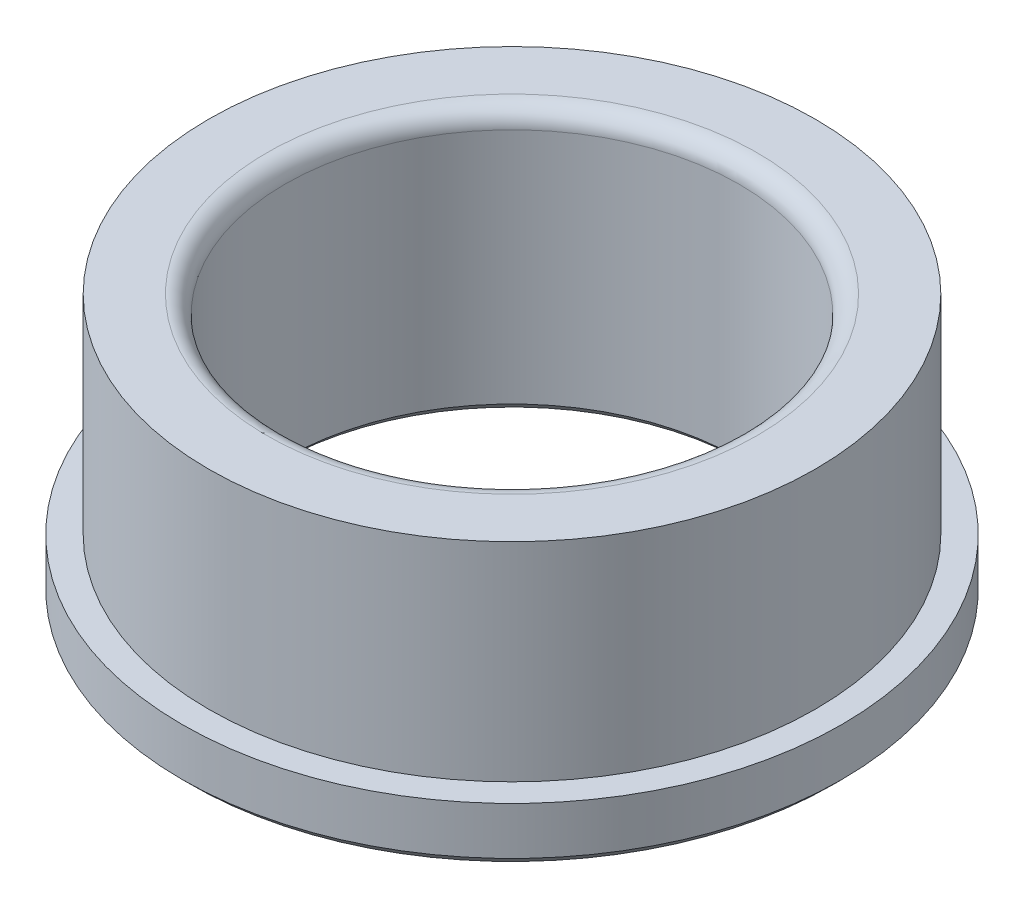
from build123d import *

# Parameters (mm, degrees)
FILLET1_R = 1.524


with BuildPart() as part:
    # Sketch1 → Revolve1 (revolve)
    with BuildSketch(Plane.XY, mode=Mode.PRIVATE) as revolve1_sk:
        Polygon((-26.924, 0), (-27.686, 0.762), (-27.686, 4.7625), (-25.4635, 4.7625), (-25.4635, 22.225), (-19.05635, 22.225), (-19.05635, 0.762), (-19.81835, 0), align=None)
    revolve(revolve1_sk.sketch.rotate(Axis((0, -1000, 0), (0, 1, 0)), 180), axis=Axis((0, -1000, 0), (0, 1, 0)))

    # Fillet1
    fillet1_edges = [part.edges().sort_by_distance(p)[0] for p in [
        (-19.05635, 22.225, 0),
    ]]
    fillet(fillet1_edges, radius=FILLET1_R)


solid = part.part
